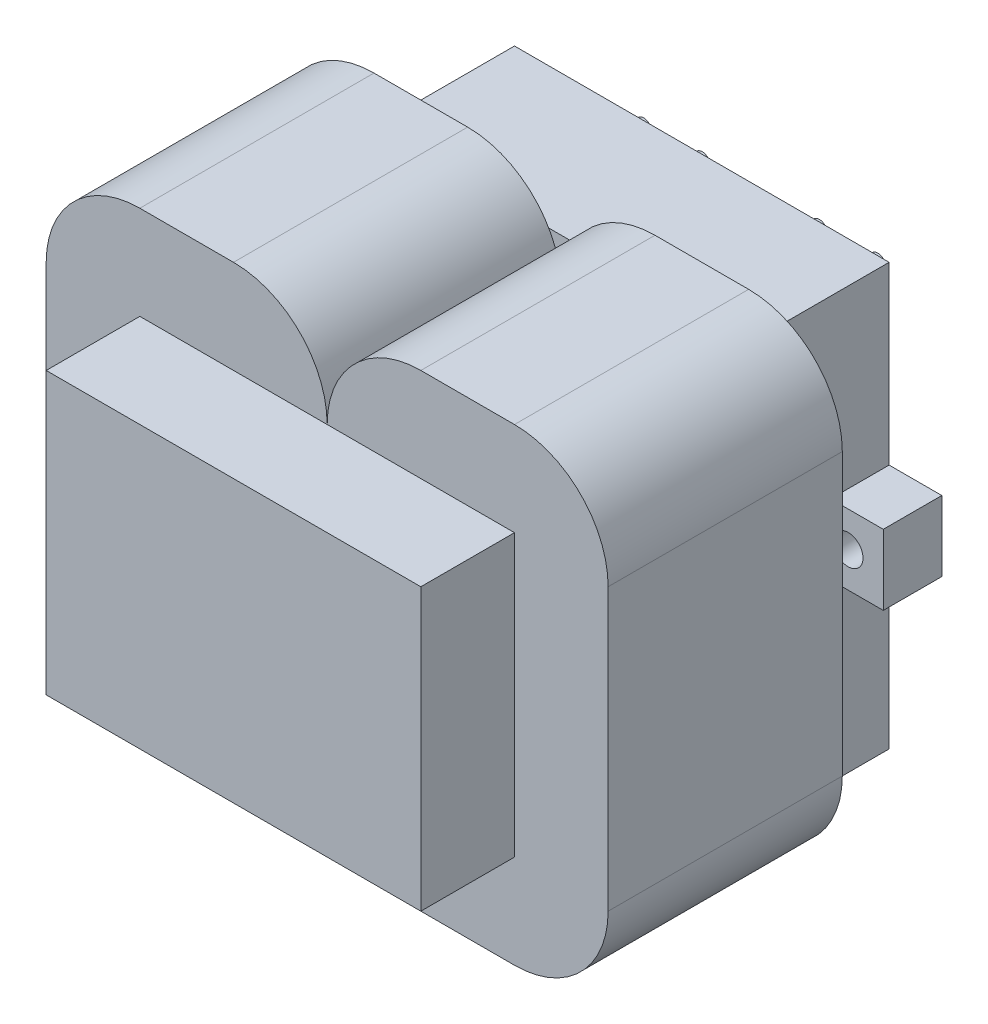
from build123d import *

# Parameters (mm, degrees)
SKETCH1_W             = 32
SKETCH1_H             = 36
BOSS_EXTRUDE1_DEPTH   = 12
SKETCH2_W             = 5
SKETCH2_H             = 6
BOSS_EXTRUDE2_DEPTH   = 4.5
SKETCH3_W             = 5
SKETCH3_H             = 6
BOSS_EXTRUDE3_DEPTH   = 4.5
SKETCH4_R             = 1.27
CUT_EXTRUDE1_DEPTH    = 5
SKETCH5_R             = 0.6604
BOSS_EXTRUDE4_DEPTH   = 2.54
BOSS_EXTRUDE4_2_DEPTH = 2.54
BOSS_EXTRUDE4_3_DEPTH = 2.54
BOSS_EXTRUDE4_4_DEPTH = 2.54
BOSS_EXTRUDE4_5_DEPTH = 2.54
BOSS_EXTRUDE4_6_DEPTH = 2.54
SKETCH6_W             = 32
SKETCH6_H             = 24
BOSS_EXTRUDE5_DEPTH   = 28
BOSS_EXTRUDE6_DEPTH   = 20


with BuildPart() as part:
    # Sketch1 → Boss-Extrude1 (new body)
    with BuildSketch(Plane.XY):
        with Locations((0, -2)):
            Rectangle(SKETCH1_W, SKETCH1_H)
    extrude(amount=BOSS_EXTRUDE1_DEPTH)

    # Sketch2 → Boss-Extrude2 (add)
    with BuildSketch(Plane(origin=(16, 0, 0), x_dir=(0, 0, -1), z_dir=(1, 0, 0))):
        with Locations((-2.5, -2)):
            Rectangle(SKETCH2_W, SKETCH2_H)
    extrude(amount=BOSS_EXTRUDE2_DEPTH)

    # Sketch3 → Boss-Extrude3 (add)
    with BuildSketch(Plane.ZY.offset(16)):
        with Locations((2.5, -2)):
            Rectangle(SKETCH3_W, SKETCH3_H)
    extrude(amount=BOSS_EXTRUDE3_DEPTH)

    # Sketch4 → Cut-Extrude1 (cut)
    with BuildSketch(Plane(origin=(0, 0, 0), x_dir=(-1, 0, 0), z_dir=(0, 0, -1))):
        with Locations((-17.5006, -1.99898)):
            Circle(SKETCH4_R)
        with Locations((17.5006, -1.99898)):
            Circle(SKETCH4_R)
    extrude(amount=-CUT_EXTRUDE1_DEPTH, mode=Mode.SUBTRACT)

    # Sketch6 → Boss-Extrude5 (add)
    with BuildSketch(Plane.XY.offset(12)):
        Rectangle(SKETCH6_W, SKETCH6_H)
    extrude(amount=BOSS_EXTRUDE5_DEPTH)


with BuildPart() as body_2:
    # Sketch5 → Boss-Extrude4 (new body)
    with BuildSketch(Plane(origin=(0, 0, 0), x_dir=(-1, 0, 0), z_dir=(0, 0, -1))):
        with Locations((-9.99998, -12.99972)):
            Circle(SKETCH5_R)
    extrude(amount=BOSS_EXTRUDE4_DEPTH)


with BuildPart() as body_3:
    # Sketch5 → Boss-Extrude4 2 (new body)
    with BuildSketch(Plane(origin=(0, 0, 0), x_dir=(-1, 0, 0), z_dir=(0, 0, -1))):
        with Locations((9.99998, -12.99972)):
            Circle(SKETCH5_R)
    extrude(amount=BOSS_EXTRUDE4_2_DEPTH)


with BuildPart() as body_4:
    # Sketch5 → Boss-Extrude4 3 (new body)
    with BuildSketch(Plane(origin=(0, 0, 0), x_dir=(-1, 0, 0), z_dir=(0, 0, -1))):
        with Locations((-12.49934, 12.99972)):
            Circle(SKETCH5_R)
    extrude(amount=BOSS_EXTRUDE4_3_DEPTH)


with BuildPart() as body_5:
    # Sketch5 → Boss-Extrude4 4 (new body)
    with BuildSketch(Plane(origin=(0, 0, 0), x_dir=(-1, 0, 0), z_dir=(0, 0, -1))):
        with Locations((-7.50062, 12.99972)):
            Circle(SKETCH5_R)
    extrude(amount=BOSS_EXTRUDE4_4_DEPTH)


with BuildPart() as body_6:
    # Sketch5 → Boss-Extrude4 5 (new body)
    with BuildSketch(Plane(origin=(0, 0, 0), x_dir=(-1, 0, 0), z_dir=(0, 0, -1))):
        with Locations((2.49936, 12.99972)):
            Circle(SKETCH5_R)
    extrude(amount=BOSS_EXTRUDE4_5_DEPTH)


with BuildPart() as body_7:
    # Sketch5 → Boss-Extrude4 6 (new body)
    with BuildSketch(Plane(origin=(0, 0, 0), x_dir=(-1, 0, 0), z_dir=(0, 0, -1))):
        with Locations((7.50062, 12.99972)):
            Circle(SKETCH5_R)
    extrude(amount=BOSS_EXTRUDE4_6_DEPTH)


with BuildPart() as body_8:
    # Sketch7 → Boss-Extrude6 (new body)
    with BuildSketch(Plane.XY.offset(12)):
        with BuildLine():
            Line((-16, -20), (-8, -20))
            ThreePointArc((-8, -20), (-2.343145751, -17.656854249), (0, -12))
            ThreePointArc((0, -12), (2.343145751, -17.656854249), (8, -20))
            Line((8, -20), (16, -20))
            ThreePointArc((16, -20), (21.656854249, -17.656854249), (24, -12))
            Line((24, -12), (24, 12))
            ThreePointArc((24, 12), (21.656854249, 17.656854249), (16, 20))
            Line((16, 20), (8, 20))
            ThreePointArc((8, 20), (2.343145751, 17.656854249), (0, 12))
            ThreePointArc((0, 12), (-2.343145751, 17.656854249), (-8, 20))
            Line((-8, 20), (-16, 20))
            ThreePointArc((-16, 20), (-21.656854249, 17.656854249), (-24, 12))
            Line((-24, 12), (-24, -12))
            ThreePointArc((-24, -12), (-21.656854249, -17.656854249), (-16, -20))
        make_face()
    extrude(amount=BOSS_EXTRUDE6_DEPTH)


solid = Compound([part.part, body_2.part, body_3.part, body_4.part, body_5.part, body_6.part, body_7.part, body_8.part])
